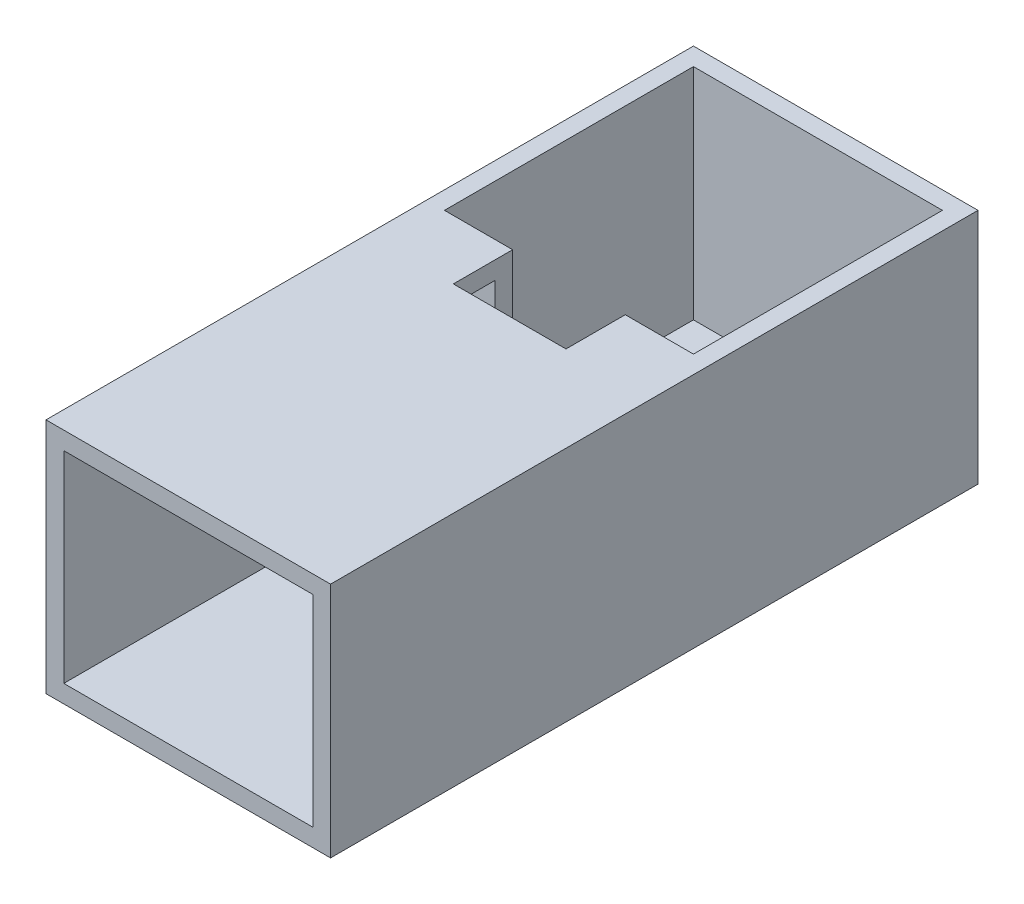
from build123d import *

# Parameters (mm, degrees)
SALIENTE_EXTRUIR1_DEPTH = 3
SALIENTE_EXTRUIR4_DEPTH = 40
CROQUIS6_W              = 48
CROQUIS6_H              = 40
CROQUIS6_W_2            = 42
CROQUIS6_H_2            = 34
SALIENTE_EXTRUIR5_DEPTH = 61.21
CORTAR_EXTRUIR1_REACH   = 89.768
CROQUIS7_W              = 19
CROQUIS7_H              = 10


with BuildPart() as part:
    # Croquis1 → Saliente-Extruir1 (new body)
    with BuildSketch(Plane(origin=(0, 0, 0), x_dir=(1, 0, 0), z_dir=(0, 1, 0))):
        Polygon((3.997199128, 0), (37.002800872, 0), (41.5, 0), (41.5, 4.497199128), (41.5, 37.502800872), (41.5, 42), (37.002800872, 42), (3.997199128, 42), (-0.5, 42), (-0.5, 37.502800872), (-0.5, 4.497199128), (-0.5, 0), align=None)
    extrude(amount=SALIENTE_EXTRUIR1_DEPTH)

    # Croquis4 → Saliente-Extruir4 (add)
    with BuildSketch(Plane(origin=(0, 0, 0), x_dir=(1, 0, 0), z_dir=(0, 1, 0))):
        Polygon((-3.5, -3), (-3.5, 45), (44.5, 45), (44.5, -3), (29.5, -3), (11.5, -3), align=None)
        Polygon((-0.5, 0), (11.5, 0), (29.5, 0), (41.5, 0), (41.5, 42), (-0.5, 42), align=None, mode=Mode.SUBTRACT)
    extrude(amount=SALIENTE_EXTRUIR4_DEPTH)

    # Croquis6 → Saliente-Extruir5 (add)
    with BuildSketch(Plane.XY.offset(3)):
        with Locations((20.5, 20)):
            Rectangle(CROQUIS6_W, CROQUIS6_H)
        with Locations((20.5, 20)):
            Rectangle(CROQUIS6_W_2, CROQUIS6_H_2, mode=Mode.SUBTRACT)
    extrude(amount=SALIENTE_EXTRUIR5_DEPTH)

    # Cortar-Extruir1: up to this face of the body (flat: up to its plane)
    cortar_extruir1_end = Plane(part.part.faces().sort_by_distance((20.5, 3, -21))[0])
    # Croquis7 → Cortar-Extruir1 (cut, up to the picked face)
    with BuildSketch(Plane(origin=(0, 40, 0), x_dir=(1, 0, 0), z_dir=(0, 1, 0)), mode=Mode.PRIVATE) as cortar_extruir1_sk1:
        with Locations((20.5, -5)):
            Rectangle(CROQUIS7_W, CROQUIS7_H)
    cortar_extruir1_tool1 = split(extrude(cortar_extruir1_sk1.sketch, amount=-CORTAR_EXTRUIR1_REACH, mode=Mode.PRIVATE), bisect_by=cortar_extruir1_end, keep=Keep.BOTH, mode=Mode.PRIVATE)
    add(cortar_extruir1_tool1.solids().sort_by(Axis((20.5, 40, 5), (0, -1, 0)))[0], mode=Mode.SUBTRACT)


solid = part.part
